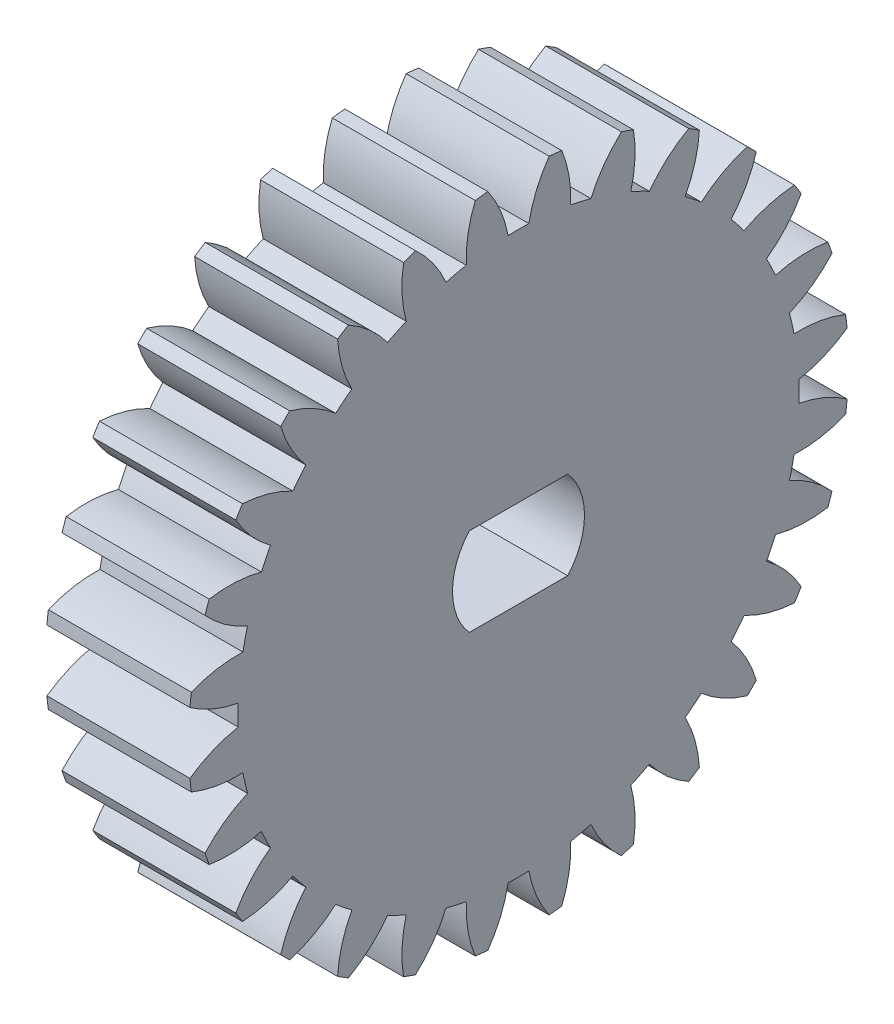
from build123d import *

# Parameters (mm, degrees)
BASPROSKE_W     = 6.5
BASPROSKE_H     = 15
TOOTHCUT_DEPTH  = 23.186707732
TEETHCUTS_COUNT = 28
BORE_DEPTH      = 50.0000508


with BuildPart() as part:
    # BasProSke → Base-Revolve (revolve)
    with BuildSketch(Plane(origin=(0, 0, 0), x_dir=(1, 0, 0), z_dir=(0, 1, 0)), mode=Mode.PRIVATE) as base_revolve_sk:
        with Locations((3.25, 7.5)):
            Rectangle(BASPROSKE_W, BASPROSKE_H)
    revolve(base_revolve_sk.sketch.rotate(Axis((-10, 0, 0), (1, 0, 0)), 180), axis=Axis((-10, 0, 0), (1, 0, 0)))

    # TooCutSke → ToothCut (cut, through all)
    with BuildSketch(Plane(origin=(0, 0, 0), x_dir=(0, 0, -1), z_dir=(1, 0, 0))):
        with BuildLine():
            ThreePointArc((0.471336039, 12.740284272), (0, 12.749), (-0.471336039, 12.740284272))
            ThreePointArc((-0.471336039, 12.740284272), (-0.81983923, 13.900763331), (-1.409805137, 14.959114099))
            ThreePointArc((-1.409805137, 14.959114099), (0, 15.0254), (1.409805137, 14.959114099))
            ThreePointArc((1.409805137, 14.959114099), (0.81983923, 13.900763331), (0.471336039, 12.740284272))
        make_face()
    toothcut = extrude(amount=TOOTHCUT_DEPTH, mode=Mode.SUBTRACT)

    # TeethCuts: ToothCut ×28 about axis
    teethcuts_axis = Axis((0, 0, 0), (1, 0, 0))
    for i in range(1, TEETHCUTS_COUNT):
        add(toothcut.rotate(teethcuts_axis, i * 360 / TEETHCUTS_COUNT), mode=Mode.SUBTRACT)

    # BorSke → Bore (cut, symmetric)
    with BuildSketch(Plane(origin=(0, 0, 0), x_dir=(0, 0, -1), z_dir=(1, 0, 0))):
        with BuildLine():
            Line((-2.236067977, 2), (2.236067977, 2))
            ThreePointArc((2.236067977, 2), (3, 0), (2.236067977, -2))
            Line((2.236067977, -2), (-2.236067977, -2))
            ThreePointArc((-2.236067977, -2), (-3, 0), (-2.236067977, 2))
        make_face()
    extrude(amount=BORE_DEPTH, both=True, mode=Mode.SUBTRACT)


solid = part.part
